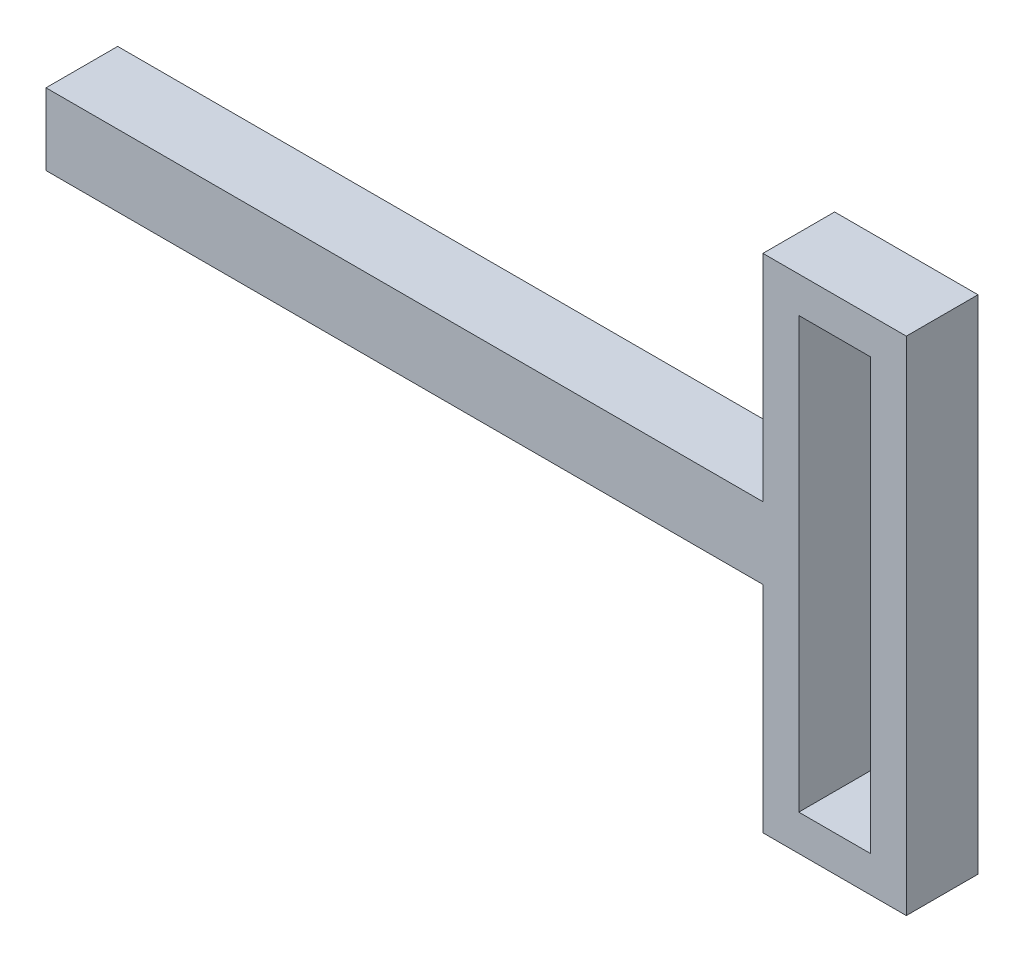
from build123d import *

# Parameters (mm, degrees)
BOSS_EXTRUDE1_DEPTH = 10
SKETCH2_W           = 10
SKETCH2_H           = 60
CUT_EXTRUDE1_DEPTH  = 127.885775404


with BuildPart() as part:
    # Sketch1 → Boss-Extrude1 (new body)
    with BuildSketch(Plane.XY):
        Polygon((0, 0), (0, 10), (100, 10), (100, 40), (120, 40), (120, -30), (100, -30), (100, 0), align=None)
    extrude(amount=BOSS_EXTRUDE1_DEPTH)

    # Sketch2 → Cut-Extrude1 (cut, through all)
    with BuildSketch(Plane.XY.offset(10)):
        with Locations((110, 5)):
            Rectangle(SKETCH2_W, SKETCH2_H)
    extrude(amount=-CUT_EXTRUDE1_DEPTH, mode=Mode.SUBTRACT)


solid = part.part
